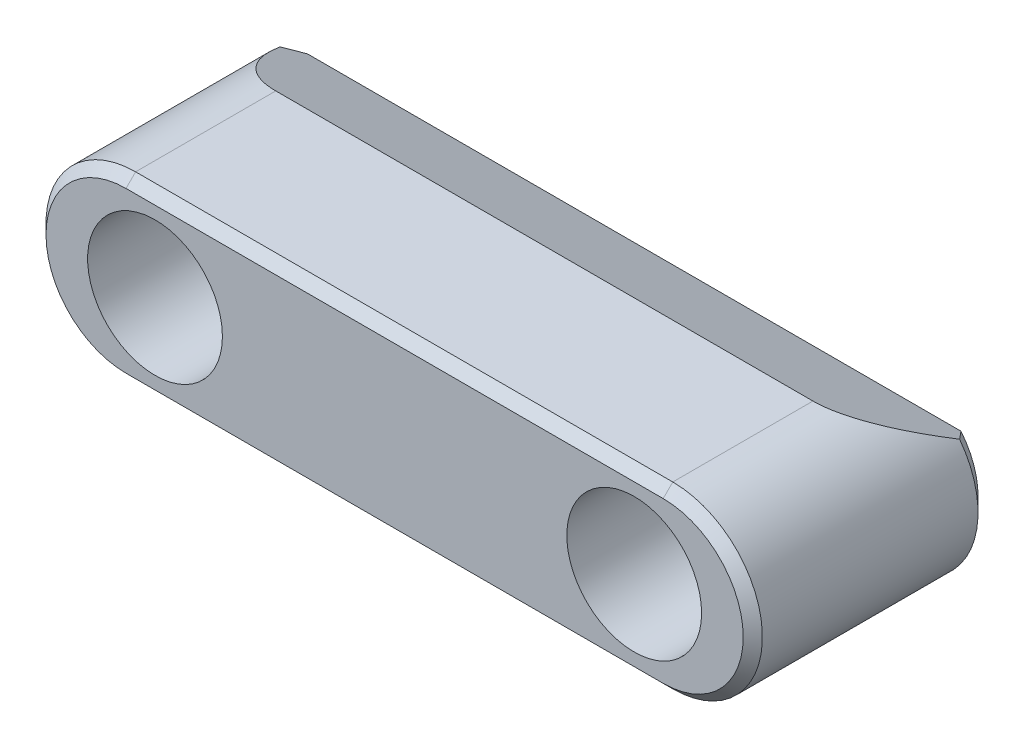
from build123d import *

# Parameters (mm, degrees)
BOSS_EXTRUDE2_DEPTH                            = 12.7
CBORE_FOR_6_SOCKET_HEAD_CAP_SCREW1_D           = 4.3053
CBORE_FOR_6_SOCKET_HEAD_CAP_SCREW1_CBORE_D     = 7.14502
CBORE_FOR_6_SOCKET_HEAD_CAP_SCREW1_CBORE_DEPTH = 5.08
CUT_EXTRUDE1_DEPTH                             = 24.331047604
CUT_EXTRUDE1_DEPTH_BACK                        = 24.331047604
CHAMFER1_SIZE                                  = 0.508
CHAMFER2_SIZE                                  = 0.762


with BuildPart() as part:
    # Sketch2 → Boss-Extrude2 (new body)
    with BuildSketch(Plane.XY):
        with BuildLine():
            Line((-14.2367, 4.7498), (14.2367, 4.7498))
            ThreePointArc((14.2367, 4.7498), (18.9865, 0), (14.2367, -4.7498))
            Line((14.2367, -4.7498), (-14.2367, -4.7498))
            ThreePointArc((-14.2367, -4.7498), (-18.9865, 0), (-14.2367, 4.7498))
        make_face()
    extrude(amount=-BOSS_EXTRUDE2_DEPTH)

    # CBORE for _6 Socket Head Cap Screw1 (through all)
    with Locations(Plane.XY):
        with Locations((-12.7, 0), (12.7, 0)):
            CounterBoreHole(CBORE_FOR_6_SOCKET_HEAD_CAP_SCREW1_D / 2, CBORE_FOR_6_SOCKET_HEAD_CAP_SCREW1_CBORE_D / 2, CBORE_FOR_6_SOCKET_HEAD_CAP_SCREW1_CBORE_DEPTH)

    # Sketch9 → Cut-Extrude1 (cut, two sides: drawn at the far end of the back side and taken through both)
    with BuildSketch(Plane(origin=(0, 0, 0), x_dir=(0, 0, -1), z_dir=(1, 0, 0)).offset(-CUT_EXTRUDE1_DEPTH_BACK)):
        Polygon((12.7, 4.7498), (7.9375, 4.7498), (12.7, 2.529009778), align=None)
    extrude(amount=CUT_EXTRUDE1_DEPTH + CUT_EXTRUDE1_DEPTH_BACK, mode=Mode.SUBTRACT)

    # Chamfer1
    chamfer1_edges = [part.edges().sort_by_distance(p)[0] for p in [
        (0, 4.7498, 0),
        (18.9865, 0, 0),
        (0, -4.7498, 0),
        (-18.9865, 0, 0),
    ]]
    chamfer(chamfer1_edges, length=CHAMFER1_SIZE)

    # Chamfer2
    chamfer2_edges = [part.edges().sort_by_distance(p)[0] for p in [
        (-18.39439712, -2.296552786, -12.7),
        (18.39439712, -2.296552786, -12.7),
        (0, -4.7498, -12.7),
    ]]
    chamfer(chamfer2_edges, length=CHAMFER2_SIZE)


solid = part.part
